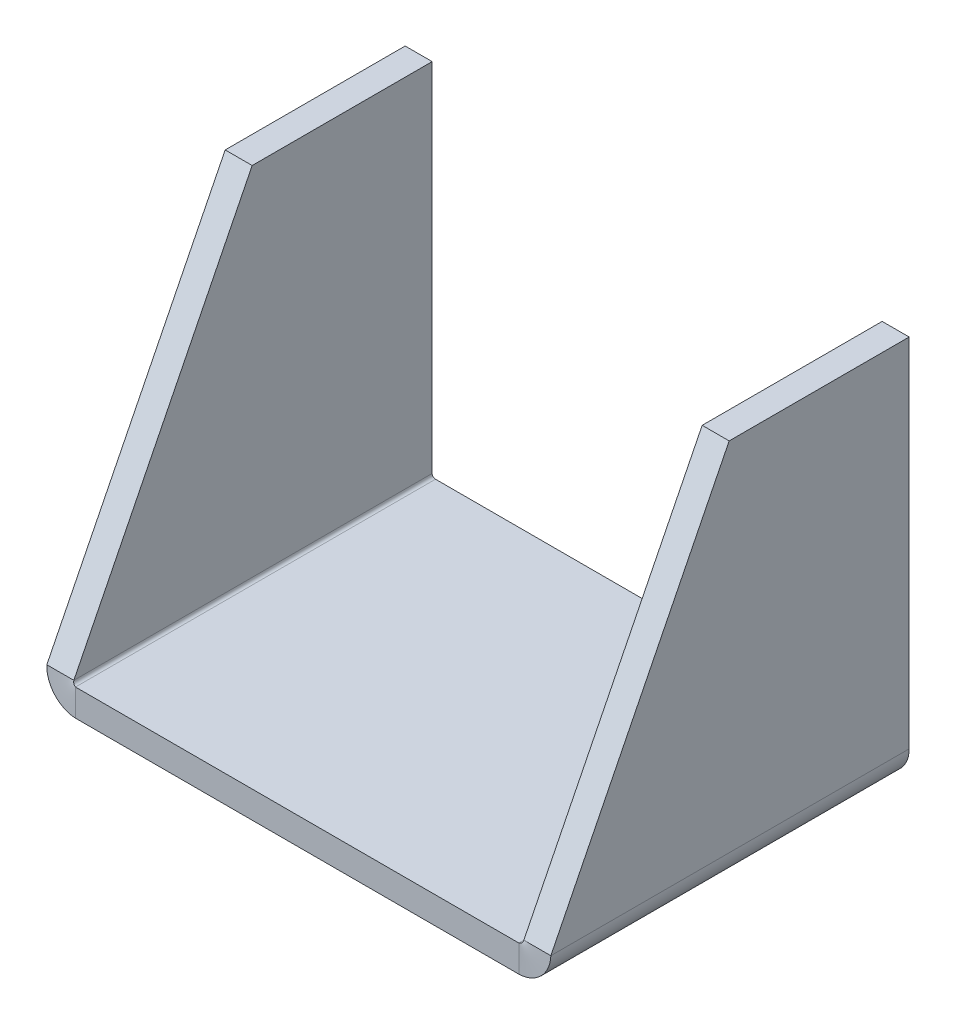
ISO-10303-21;
HEADER;
FILE_DESCRIPTION(('STEP AP214'),'2;1');
FILE_NAME('part.step','',(''),(''),'','','');
FILE_SCHEMA(('AUTOMOTIVE_DESIGN { 1 0 10303 214 1 1 1 1 }'));
ENDSEC;
DATA;
#1=APPLICATION_CONTEXT('core data for automotive mechanical design processes');
#2=APPLICATION_PROTOCOL_DEFINITION('international standard','automotive_design',2000,#1);
#3=PRODUCT_CONTEXT('',#1,'mechanical');
#4=PRODUCT('Part','Part','',(#3));
#5=PRODUCT_RELATED_PRODUCT_CATEGORY('part','',(#4));
#6=PRODUCT_DEFINITION_FORMATION('','',#4);
#7=PRODUCT_DEFINITION_CONTEXT('part definition',#1,'design');
#8=PRODUCT_DEFINITION('design','',#6,#7);
#9=PRODUCT_DEFINITION_SHAPE('','',#8);
#10=(LENGTH_UNIT() NAMED_UNIT(*) SI_UNIT(.MILLI.,.METRE.));
#11=(NAMED_UNIT(*) PLANE_ANGLE_UNIT() SI_UNIT($,.RADIAN.));
#12=(NAMED_UNIT(*) SI_UNIT($,.STERADIAN.) SOLID_ANGLE_UNIT());
#13=UNCERTAINTY_MEASURE_WITH_UNIT(LENGTH_MEASURE(1.E-05),#10,'distance_accuracy_value','');
#14=(GEOMETRIC_REPRESENTATION_CONTEXT(3) GLOBAL_UNCERTAINTY_ASSIGNED_CONTEXT((#13)) GLOBAL_UNIT_ASSIGNED_CONTEXT((#10,
#11,#12)) REPRESENTATION_CONTEXT('',''));
#15=CARTESIAN_POINT('',(0.,0.,0.));
#16=DIRECTION('',(0.,0.,1.));
#17=DIRECTION('',(1.,0.,0.));
#18=AXIS2_PLACEMENT_3D('',#15,#16,#17);
#19=CARTESIAN_POINT('',(-50.,-6.,80.));
#20=DIRECTION('',(0.,1.,0.));
#21=DIRECTION('',(0.,0.,1.));
#22=AXIS2_PLACEMENT_3D('',#19,#20,#21);
#23=PLANE('',#22);
#24=DIRECTION('',(0.,0.,-1.));
#25=VECTOR('',#24,1.);
#26=CARTESIAN_POINT('',(49.2634,-6.00000000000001,0.));
#27=LINE('',#26,#25);
#28=CARTESIAN_POINT('',(49.2634,-6.00000000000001,0.));
#29=VERTEX_POINT('',#28);
#30=CARTESIAN_POINT('',(49.2634,-6.00000000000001,80.));
#31=VERTEX_POINT('',#30);
#32=EDGE_CURVE('E174',#29,#31,#27,.F.);
#33=ORIENTED_EDGE('',*,*,#32,.T.);
#34=DIRECTION('',(1.,0.,0.));
#35=VECTOR('',#34,1.);
#36=CARTESIAN_POINT('',(-50.,-6.,80.));
#37=LINE('',#36,#35);
#38=CARTESIAN_POINT('',(-49.2634,-6.00000000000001,80.));
#39=VERTEX_POINT('',#38);
#40=EDGE_CURVE('E50',#39,#31,#37,.T.);
#41=ORIENTED_EDGE('',*,*,#40,.F.);
#42=DIRECTION('',(0.,0.,1.));
#43=VECTOR('',#42,1.);
#44=CARTESIAN_POINT('',(-49.2634,-6.00000000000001,80.));
#45=LINE('',#44,#43);
#46=CARTESIAN_POINT('',(-49.2634,-6.,0.));
#47=VERTEX_POINT('',#46);
#48=EDGE_CURVE('E260',#39,#47,#45,.F.);
#49=ORIENTED_EDGE('',*,*,#48,.T.);
#50=DIRECTION('',(1.,0.,0.));
#51=VECTOR('',#50,1.);
#52=CARTESIAN_POINT('',(-50.,-6.00000000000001,0.));
#53=LINE('',#52,#51);
#54=EDGE_CURVE('E334',#47,#29,#53,.T.);
#55=ORIENTED_EDGE('',*,*,#54,.T.);
#56=EDGE_LOOP('',(#33,#41,#49,#55));
#57=FACE_BOUND('',#56,.T.);
#58=ADVANCED_FACE('F43',(#57),#23,.F.);
#59=CARTESIAN_POINT('',(-49.9999999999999,0.,80.));
#60=DIRECTION('',(0.,1.,0.));
#61=DIRECTION('',(0.,0.,1.));
#62=AXIS2_PLACEMENT_3D('',#59,#60,#61);
#63=PLANE('',#62);
#64=DIRECTION('',(1.,0.,0.));
#65=VECTOR('',#64,1.);
#66=CARTESIAN_POINT('',(-49.9999999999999,0.,80.));
#67=LINE('',#66,#65);
#68=CARTESIAN_POINT('',(-49.2633999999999,0.,80.));
#69=VERTEX_POINT('',#68);
#70=CARTESIAN_POINT('',(49.2634,0.,80.));
#71=VERTEX_POINT('',#70);
#72=EDGE_CURVE('E11',#69,#71,#67,.T.);
#73=ORIENTED_EDGE('',*,*,#72,.T.);
#74=DIRECTION('',(0.,0.,-1.));
#75=VECTOR('',#74,1.);
#76=CARTESIAN_POINT('',(49.2634,0.,0.));
#77=LINE('',#76,#75);
#78=CARTESIAN_POINT('',(49.2634,0.,0.));
#79=VERTEX_POINT('',#78);
#80=EDGE_CURVE('E170',#79,#71,#77,.F.);
#81=ORIENTED_EDGE('',*,*,#80,.F.);
#82=DIRECTION('',(1.,0.,0.));
#83=VECTOR('',#82,1.);
#84=CARTESIAN_POINT('',(-50.,0.,0.));
#85=LINE('',#84,#83);
#86=CARTESIAN_POINT('',(-49.2634,0.,0.));
#87=VERTEX_POINT('',#86);
#88=EDGE_CURVE('E336',#87,#79,#85,.T.);
#89=ORIENTED_EDGE('',*,*,#88,.F.);
#90=DIRECTION('',(0.,0.,1.));
#91=VECTOR('',#90,1.);
#92=CARTESIAN_POINT('',(-49.2633999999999,0.,80.));
#93=LINE('',#92,#91);
#94=EDGE_CURVE('E56',#69,#87,#93,.F.);
#95=ORIENTED_EDGE('',*,*,#94,.F.);
#96=EDGE_LOOP('',(#73,#81,#89,#95));
#97=FACE_BOUND('',#96,.T.);
#98=ADVANCED_FACE('F305',(#97),#63,.T.);
#99=CARTESIAN_POINT('',(50.,-6.00000000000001,80.));
#100=DIRECTION('',(0.,0.,-1.));
#101=DIRECTION('',(-1.,0.,0.));
#102=AXIS2_PLACEMENT_3D('',#99,#100,#101);
#103=PLANE('',#102);
#104=DIRECTION('',(0.,-1.,0.));
#105=VECTOR('',#104,1.);
#106=CARTESIAN_POINT('',(49.2634,0.,80.));
#107=LINE('',#106,#105);
#108=EDGE_CURVE('E218',#71,#31,#107,.T.);
#109=ORIENTED_EDGE('',*,*,#108,.F.);
#110=ORIENTED_EDGE('',*,*,#72,.F.);
#111=DIRECTION('',(0.,-1.,0.));
#112=VECTOR('',#111,1.);
#113=CARTESIAN_POINT('',(-49.2633999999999,0.,80.));
#114=LINE('',#113,#112);
#115=EDGE_CURVE('E259',#69,#39,#114,.T.);
#116=ORIENTED_EDGE('',*,*,#115,.T.);
#117=ORIENTED_EDGE('',*,*,#40,.T.);
#118=EDGE_LOOP('',(#109,#110,#116,#117));
#119=FACE_BOUND('',#118,.T.);
#120=ADVANCED_FACE('F303',(#119),#103,.F.);
#121=CARTESIAN_POINT('',(50.,-6.00000000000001,0.));
#122=DIRECTION('',(0.,0.,-1.));
#123=DIRECTION('',(-1.,0.,0.));
#124=AXIS2_PLACEMENT_3D('',#121,#122,#123);
#125=PLANE('',#124);
#126=ORIENTED_EDGE('',*,*,#88,.T.);
#127=DIRECTION('',(0.,-1.,0.));
#128=VECTOR('',#127,1.);
#129=CARTESIAN_POINT('',(49.2634,0.,0.));
#130=LINE('',#129,#128);
#131=EDGE_CURVE('E210',#79,#29,#130,.T.);
#132=ORIENTED_EDGE('',*,*,#131,.T.);
#133=ORIENTED_EDGE('',*,*,#54,.F.);
#134=DIRECTION('',(0.,-1.,0.));
#135=VECTOR('',#134,1.);
#136=CARTESIAN_POINT('',(-49.2634,0.,0.));
#137=LINE('',#136,#135);
#138=EDGE_CURVE('E64',#87,#47,#137,.T.);
#139=ORIENTED_EDGE('',*,*,#138,.F.);
#140=EDGE_LOOP('',(#126,#132,#133,#139));
#141=FACE_BOUND('',#140,.T.);
#142=ADVANCED_FACE('F289',(#141),#125,.T.);
#143=CARTESIAN_POINT('',(-49.2634,0.736600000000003,0.));
#144=DIRECTION('',(0.,0.,-1.));
#145=DIRECTION('',(0.,1.,0.));
#146=AXIS2_PLACEMENT_3D('',#143,#144,#145);
#147=PLANE('',#146);
#148=DIRECTION('',(-1.,0.,0.));
#149=VECTOR('',#148,1.);
#150=CARTESIAN_POINT('',(-50.,0.7366,0.));
#151=LINE('',#150,#149);
#152=CARTESIAN_POINT('',(-50.,0.736600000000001,0.));
#153=VERTEX_POINT('',#152);
#154=CARTESIAN_POINT('',(-56.,0.73659999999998,0.));
#155=VERTEX_POINT('',#154);
#156=EDGE_CURVE('E221',#153,#155,#151,.T.);
#157=ORIENTED_EDGE('',*,*,#156,.F.);
#158=CARTESIAN_POINT('',(-49.2634,0.736600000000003,0.));
#159=DIRECTION('',(0.,0.,1.));
#160=DIRECTION('',(0.,-1.,0.));
#161=AXIS2_PLACEMENT_3D('',#158,#159,#160);
#162=CIRCLE('',#161,0.736599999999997);
#163=EDGE_CURVE('E252',#87,#153,#162,.F.);
#164=ORIENTED_EDGE('',*,*,#163,.F.);
#165=ORIENTED_EDGE('',*,*,#138,.T.);
#166=CARTESIAN_POINT('',(-49.2634,0.736600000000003,0.));
#167=DIRECTION('',(0.,0.,1.));
#168=DIRECTION('',(0.,-1.,0.));
#169=AXIS2_PLACEMENT_3D('',#166,#167,#168);
#170=CIRCLE('',#169,6.7366);
#171=EDGE_CURVE('E256',#47,#155,#170,.F.);
#172=ORIENTED_EDGE('',*,*,#171,.T.);
#173=EDGE_LOOP('',(#157,#164,#165,#172));
#174=FACE_BOUND('',#173,.T.);
#175=ADVANCED_FACE('F286',(#174),#147,.T.);
#176=CARTESIAN_POINT('',(-56.0599999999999,0.736599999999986,79.6317));
#177=CARTESIAN_POINT('',(-56.0599999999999,-0.153233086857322,79.6623971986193));
#178=CARTESIAN_POINT('',(-55.8831026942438,-1.0423956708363,79.6930833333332));
#179=CARTESIAN_POINT('',(-55.2021765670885,-2.68629676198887,79.7544666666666));
#180=CARTESIAN_POINT('',(-54.6984156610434,-3.44022823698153,79.7851583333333));
#181=CARTESIAN_POINT('',(-53.4402282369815,-4.69841566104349,79.8465416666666));
#182=CARTESIAN_POINT('',(-52.6862967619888,-5.20217656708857,79.8772333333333));
#183=CARTESIAN_POINT('',(-51.0423956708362,-5.88310269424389,79.9386166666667));
#184=CARTESIAN_POINT('',(-50.1532330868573,-6.06,79.9693028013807));
#185=CARTESIAN_POINT('',(-49.2634,-6.06000000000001,80.));
#186=CARTESIAN_POINT('',(-56.,0.736599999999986,79.6317));
#187=CARTESIAN_POINT('',(-56.,-0.145377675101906,79.6623971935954));
#188=CARTESIAN_POINT('',(-55.8246643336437,-1.02669079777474,79.6930833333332));
#189=CARTESIAN_POINT('',(-55.1497493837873,-2.65607962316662,79.7544666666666));
#190=CARTESIAN_POINT('',(-54.6504356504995,-3.40335543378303,79.7851583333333));
#191=CARTESIAN_POINT('',(-53.403355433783,-4.6504356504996,79.8465416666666));
#192=CARTESIAN_POINT('',(-52.6560796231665,-5.14974938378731,79.8772333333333));
#193=CARTESIAN_POINT('',(-51.0266907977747,-5.82466433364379,79.9386166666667));
#194=CARTESIAN_POINT('',(-50.1453776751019,-6.,79.9693028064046));
#195=CARTESIAN_POINT('',(-49.2634,-6.00000000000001,80.));
#196=CARTESIAN_POINT('',(-50.,0.736599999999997,79.6317));
#197=CARTESIAN_POINT('',(-50.,0.640163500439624,79.662396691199));
#198=CARTESIAN_POINT('',(-49.9808282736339,0.543796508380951,79.6930833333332));
#199=CARTESIAN_POINT('',(-49.9070310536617,0.365634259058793,79.7544666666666));
#200=CARTESIAN_POINT('',(-49.8524345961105,0.283924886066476,79.7851583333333));
#201=CARTESIAN_POINT('',(-49.7160751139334,0.1475654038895,79.8465416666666));
#202=CARTESIAN_POINT('',(-49.6343657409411,0.092968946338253,79.8772333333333));
#203=CARTESIAN_POINT('',(-49.4562034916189,0.0191717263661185,79.9386166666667));
#204=CARTESIAN_POINT('',(-49.3598364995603,0.,79.9693033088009));
#205=CARTESIAN_POINT('',(-49.2633999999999,0.,80.));
#206=CARTESIAN_POINT('',(-49.9394,0.736599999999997,79.6317));
#207=CARTESIAN_POINT('',(-49.9394,0.648097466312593,79.6623966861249));
#208=CARTESIAN_POINT('',(-49.9218055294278,0.559658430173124,79.6930833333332));
#209=CARTESIAN_POINT('',(-49.8540795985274,0.39615356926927,79.7544666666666));
#210=CARTESIAN_POINT('',(-49.8039747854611,0.321166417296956,79.7851583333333));
#211=CARTESIAN_POINT('',(-49.678833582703,0.19602521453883,79.8465416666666));
#212=CARTESIAN_POINT('',(-49.6038464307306,0.145920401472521,79.8772333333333));
#213=CARTESIAN_POINT('',(-49.4403415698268,0.0781944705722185,79.9386166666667));
#214=CARTESIAN_POINT('',(-49.3519025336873,0.0605999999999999,79.9693033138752));
#215=CARTESIAN_POINT('',(-49.2633999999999,0.0605999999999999,80.));
#216=B_SPLINE_SURFACE_WITH_KNOTS('',1,3,((#176,#177,#178,#179,#180,#181,#182,#183,#184,#185),
(#186,#187,#188,#189,#190,#191,#192,#193,#194,#195),(#196,#197,#198,#199,#200,#201,#202,#203,
#204,#205),(#206,#207,#208,#209,#210,#211,#212,#213,#214,#215)),.UNSPECIFIED.,.F.,.F.,.F.,(2,1,
1,2),(4,2,2,2,4),(-0.01,0.,1.,1.0101),(0.,0.25,0.5,0.75,1.),.UNSPECIFIED.);
#217=CARTESIAN_POINT('',(-49.9999999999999,0.736599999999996,79.6317));
#218=CARTESIAN_POINT('',(-50.0000002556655,0.724547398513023,79.6355364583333));
#219=CARTESIAN_POINT('',(-49.9997041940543,0.712494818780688,79.6393729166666));
#220=CARTESIAN_POINT('',(-49.998521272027,0.688418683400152,79.6470458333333));
#221=CARTESIAN_POINT('',(-49.9976344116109,0.67639512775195,79.6508822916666));
#222=CARTESIAN_POINT('',(-49.9952717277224,0.652406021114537,79.6585552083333));
#223=CARTESIAN_POINT('',(-49.9937959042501,0.640440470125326,79.6623916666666));
#224=CARTESIAN_POINT('',(-49.9902589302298,0.616596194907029,79.6700645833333));
#225=CARTESIAN_POINT('',(-49.9881977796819,0.604717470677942,79.6739010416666));
#226=CARTESIAN_POINT('',(-49.9834950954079,0.581075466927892,79.6815739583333));
#227=CARTESIAN_POINT('',(-49.9808535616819,0.569312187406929,79.6854104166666));
#228=CARTESIAN_POINT('',(-49.9749964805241,0.545929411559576,79.6930833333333));
#229=CARTESIAN_POINT('',(-49.9717809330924,0.534309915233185,79.6969197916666));
#230=CARTESIAN_POINT('',(-49.9647835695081,0.511242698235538,79.7045927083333));
#231=CARTESIAN_POINT('',(-49.9610017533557,0.499794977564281,79.7084291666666));
#232=CARTESIAN_POINT('',(-49.9528809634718,0.477098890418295,79.7161020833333));
#233=CARTESIAN_POINT('',(-49.9485419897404,0.465850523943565,79.7199385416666));
#234=CARTESIAN_POINT('',(-49.9393173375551,0.44358024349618,79.7276114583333));
#235=CARTESIAN_POINT('',(-49.9344316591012,0.432558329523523,79.7314479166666));
#236=CARTESIAN_POINT('',(-49.9241253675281,0.410767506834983,79.7391208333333));
#237=CARTESIAN_POINT('',(-49.9187047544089,0.399998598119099,79.7429572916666));
#238=CARTESIAN_POINT('',(-49.9073416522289,0.378739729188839,79.7506302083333));
#239=CARTESIAN_POINT('',(-49.9013991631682,0.368249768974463,79.7544666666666));
#240=CARTESIAN_POINT('',(-49.889006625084,0.34757406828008,79.7621395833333));
#241=CARTESIAN_POINT('',(-49.8825565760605,0.337388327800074,79.7659760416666));
#242=CARTESIAN_POINT('',(-49.8691644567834,0.317345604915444,79.7736489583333));
#243=CARTESIAN_POINT('',(-49.8622223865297,0.307488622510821,79.7774854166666));
#244=CARTESIAN_POINT('',(-49.8478629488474,0.288127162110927,79.7851583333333));
#245=CARTESIAN_POINT('',(-49.8404455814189,0.278622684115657,79.7889947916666));
#246=CARTESIAN_POINT('',(-49.8251534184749,0.259989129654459,79.7966677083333));
#247=CARTESIAN_POINT('',(-49.8172786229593,0.250860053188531,79.8005041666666));
#248=CARTESIAN_POINT('',(-49.8010905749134,0.232999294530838,79.8081770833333));
#249=CARTESIAN_POINT('',(-49.792777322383,0.224267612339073,79.8120135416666));
#250=CARTESIAN_POINT('',(-49.7757323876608,0.207222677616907,79.8196864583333));
#251=CARTESIAN_POINT('',(-49.7670007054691,0.198909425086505,79.8235229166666));
#252=CARTESIAN_POINT('',(-49.7491399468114,0.182721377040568,79.8311958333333));
#253=CARTESIAN_POINT('',(-49.7400108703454,0.174846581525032,79.8350322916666));
#254=CARTESIAN_POINT('',(-49.7213773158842,0.159554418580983,79.8427052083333));
#255=CARTESIAN_POINT('',(-49.711872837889,0.15213705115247,79.8465416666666));
#256=CARTESIAN_POINT('',(-49.6925113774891,0.137777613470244,79.8542145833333));
#257=CARTESIAN_POINT('',(-49.6826543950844,0.130835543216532,79.8580510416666));
#258=CARTESIAN_POINT('',(-49.6626116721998,0.117443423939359,79.8657239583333));
#259=CARTESIAN_POINT('',(-49.6524259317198,0.110993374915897,79.8695604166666));
#260=CARTESIAN_POINT('',(-49.6317502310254,0.0986008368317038,79.8772333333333));
#261=CARTESIAN_POINT('',(-49.6212602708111,0.0926583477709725,79.8810697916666));
#262=CARTESIAN_POINT('',(-49.6000014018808,0.0812952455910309,79.8887427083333));
#263=CARTESIAN_POINT('',(-49.5892324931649,0.0758746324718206,79.8925791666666));
#264=CARTESIAN_POINT('',(-49.5674416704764,0.0655683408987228,79.9002520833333));
#265=CARTESIAN_POINT('',(-49.5564197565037,0.0606826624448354,79.9040885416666));
#266=CARTESIAN_POINT('',(-49.5341494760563,0.0514580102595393,79.9117614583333));
#267=CARTESIAN_POINT('',(-49.5229011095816,0.0471190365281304,79.9155979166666));
#268=CARTESIAN_POINT('',(-49.5002050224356,0.0389982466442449,79.9232708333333));
#269=CARTESIAN_POINT('',(-49.4887573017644,0.0352164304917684,79.9271072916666));
#270=CARTESIAN_POINT('',(-49.4656900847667,0.0282190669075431,79.9347802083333));
#271=CARTESIAN_POINT('',(-49.4540705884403,0.0250035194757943,79.9386166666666));
#272=CARTESIAN_POINT('',(-49.430687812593,0.019146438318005,79.9462895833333));
#273=CARTESIAN_POINT('',(-49.418924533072,0.0165049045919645,79.9501260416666));
#274=CARTESIAN_POINT('',(-49.395282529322,0.0118022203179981,79.9577989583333));
#275=CARTESIAN_POINT('',(-49.3834038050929,0.00974106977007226,79.9616354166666));
#276=CARTESIAN_POINT('',(-49.3595595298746,0.00620409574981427,79.9693083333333));
#277=CARTESIAN_POINT('',(-49.3475939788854,0.0047282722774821,79.9731447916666));
#278=CARTESIAN_POINT('',(-49.323604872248,0.00236558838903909,79.9808177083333));
#279=CARTESIAN_POINT('',(-49.3115813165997,0.00147872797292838,79.9846541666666));
#280=CARTESIAN_POINT('',(-49.2875051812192,0.000295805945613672,79.9923270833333));
#281=CARTESIAN_POINT('',(-49.2754526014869,-2.5566559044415E-07,79.9961635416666));
#282=CARTESIAN_POINT('',(-49.2633999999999,0.,80.));
#283=B_SPLINE_CURVE_WITH_KNOTS('',3,(#217,#218,#219,#220,#221,#222,#223,#224,#225,#226,#227,
#228,#229,#230,#231,#232,#233,#234,#235,#236,#237,#238,#239,#240,#241,#242,#243,#244,#245,#246,
#247,#248,#249,#250,#251,#252,#253,#254,#255,#256,#257,#258,#259,#260,#261,#262,#263,#264,#265,
#266,#267,#268,#269,#270,#271,#272,#273,#274,#275,#276,#277,#278,#279,#280,#281,#282),
.UNSPECIFIED.,.F.,.F.,(4,2,2,2,2,2,2,2,2,2,2,2,2,2,2,2,2,2,2,2,2,2,2,2,2,2,2,2,2,2,2,2,4),(0.,
0.0379418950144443,0.0758837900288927,0.113825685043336,0.151767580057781,0.189709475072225,
0.227651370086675,0.265593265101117,0.303535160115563,0.34147705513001,0.379418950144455,
0.417360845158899,0.455302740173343,0.493244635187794,0.531186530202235,0.569128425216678,
0.607070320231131,0.645012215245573,0.682954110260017,0.720896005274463,0.75883790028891,
0.796779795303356,0.834721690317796,0.872663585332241,0.910605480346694,0.948547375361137,
0.986489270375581,1.02443116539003,1.06237306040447,1.10031495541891,1.13825685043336,
1.17619874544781,1.21414064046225),.UNSPECIFIED.);
#284=CARTESIAN_POINT('',(-50.,0.736599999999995,79.6317));
#285=VERTEX_POINT('',#284);
#286=EDGE_CURVE('E251',#285,#69,#283,.T.);
#287=DIRECTION('',(-1.,0.,0.));
#288=VECTOR('',#287,1.);
#289=CARTESIAN_POINT('',(-50.,0.736599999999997,79.6317));
#290=LINE('',#289,#288);
#291=CARTESIAN_POINT('',(-56.,0.736599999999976,79.6317));
#292=VERTEX_POINT('',#291);
#293=EDGE_CURVE('E224',#285,#292,#290,.T.);
#294=CARTESIAN_POINT('',(-55.9999999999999,0.736599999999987,79.6317));
#295=CARTESIAN_POINT('',(-56.0000023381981,0.626372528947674,79.6355364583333));
#296=CARTESIAN_POINT('',(-55.9972946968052,0.516145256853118,79.6393729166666));
#297=CARTESIAN_POINT('',(-55.9864762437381,0.295956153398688,79.6470458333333));
#298=CARTESIAN_POINT('',(-55.978365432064,0.185994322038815,79.6508822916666));
#299=CARTESIAN_POINT('',(-55.9567574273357,-0.0333988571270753,79.6585552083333));
#300=CARTESIAN_POINT('',(-55.9432602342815,-0.142830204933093,79.6623916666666));
#301=CARTESIAN_POINT('',(-55.9109127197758,-0.36089882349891,79.6700645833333));
#302=CARTESIAN_POINT('',(-55.8920623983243,-0.469536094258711,79.6739010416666));
#303=CARTESIAN_POINT('',(-55.8490538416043,-0.685754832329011,79.6815739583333));
#304=CARTESIAN_POINT('',(-55.8248956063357,-0.793336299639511,79.6854104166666));
#305=CARTESIAN_POINT('',(-55.7713294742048,-1.00718426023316,79.6930833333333));
#306=CARTESIAN_POINT('',(-55.7419215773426,-1.11345075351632,79.6969197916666));
#307=CARTESIAN_POINT('',(-55.6779269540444,-1.32441276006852,79.7045927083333));
#308=CARTESIAN_POINT('',(-55.6433402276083,-1.42910827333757,79.7084291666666));
#309=CARTESIAN_POINT('',(-55.5690712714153,-1.63667609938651,79.7161020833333));
#310=CARTESIAN_POINT('',(-55.5293890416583,-1.73954841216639,79.7199385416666));
#311=CARTESIAN_POINT('',(-55.4450246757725,-1.94322200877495,79.7276114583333));
#312=CARTESIAN_POINT('',(-55.4003425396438,-2.04402329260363,79.7314479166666));
#313=CARTESIAN_POINT('',(-55.3060860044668,-2.24331199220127,79.7391208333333));
#314=CARTESIAN_POINT('',(-55.2565116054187,-2.34179940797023,79.7429572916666));
#315=CARTESIAN_POINT('',(-55.1525899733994,-2.53622310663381,79.7506302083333));
#316=CARTESIAN_POINT('',(-55.0982427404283,-2.63215938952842,79.7544666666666));
#317=CARTESIAN_POINT('',(-54.9849063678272,-2.82124970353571,79.7621395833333));
#318=CARTESIAN_POINT('',(-54.9259172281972,-2.9144037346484,79.7659760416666));
#319=CARTESIAN_POINT('',(-54.8034391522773,-3.09770512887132,79.7736489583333));
#320=CARTESIAN_POINT('',(-54.7399502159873,-3.18785249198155,79.7774854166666));
#321=CARTESIAN_POINT('',(-54.6086254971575,-3.36492337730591,79.7851583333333));
#322=CARTESIAN_POINT('',(-54.5407897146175,-3.45184689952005,79.7889947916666));
#323=CARTESIAN_POINT('',(-54.4009347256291,-3.62226069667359,79.7966677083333));
#324=CARTESIAN_POINT('',(-54.3289155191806,-3.70575097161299,79.8005041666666));
#325=CARTESIAN_POINT('',(-54.1808671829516,-3.86909713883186,79.8081770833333));
#326=CARTESIAN_POINT('',(-54.1048380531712,-3.94895303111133,79.8120135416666));
#327=CARTESIAN_POINT('',(-53.9489530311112,-4.10483805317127,79.8196864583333));
#328=CARTESIAN_POINT('',(-53.8690971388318,-4.18086718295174,79.8235229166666));
#329=CARTESIAN_POINT('',(-53.7057509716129,-4.3289155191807,79.8311958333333));
#330=CARTESIAN_POINT('',(-53.6222606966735,-4.4009347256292,79.8350322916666));
#331=CARTESIAN_POINT('',(-53.4518468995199,-4.54078971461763,79.8427052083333));
#332=CARTESIAN_POINT('',(-53.3649233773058,-4.60862549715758,79.8465416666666));
#333=CARTESIAN_POINT('',(-53.1878524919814,-4.73995021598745,79.8542145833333));
#334=CARTESIAN_POINT('',(-53.0977051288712,-4.80343915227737,79.8580510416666));
#335=CARTESIAN_POINT('',(-52.9144037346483,-4.92591722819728,79.8657239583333));
#336=CARTESIAN_POINT('',(-52.8212497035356,-4.98490636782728,79.8695604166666));
#337=CARTESIAN_POINT('',(-52.6321593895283,-5.09824274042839,79.8772333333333));
#338=CARTESIAN_POINT('',(-52.5362231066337,-5.15258997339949,79.8810697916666));
#339=CARTESIAN_POINT('',(-52.3417994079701,-5.25651160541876,79.8887427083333));
#340=CARTESIAN_POINT('',(-52.2433119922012,-5.30608600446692,79.8925791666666));
#341=CARTESIAN_POINT('',(-52.0440232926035,-5.40034253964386,79.9002520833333));
#342=CARTESIAN_POINT('',(-51.9432220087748,-5.44502467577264,79.9040885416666));
#343=CARTESIAN_POINT('',(-51.7395484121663,-5.52938904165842,79.9117614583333));
#344=CARTESIAN_POINT('',(-51.6366760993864,-5.56907127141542,79.9155979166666));
#345=CARTESIAN_POINT('',(-51.4291082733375,-5.64334022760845,79.9232708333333));
#346=CARTESIAN_POINT('',(-51.3244127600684,-5.67792695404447,79.9271072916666));
#347=CARTESIAN_POINT('',(-51.1134507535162,-5.74192157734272,79.9347802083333));
#348=CARTESIAN_POINT('',(-51.0071842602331,-5.77132947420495,79.9386166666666));
#349=CARTESIAN_POINT('',(-50.7933362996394,-5.82489560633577,79.9462895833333));
#350=CARTESIAN_POINT('',(-50.6857548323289,-5.84905384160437,79.9501260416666));
#351=CARTESIAN_POINT('',(-50.4695360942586,-5.89206239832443,79.9577989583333));
#352=CARTESIAN_POINT('',(-50.3608988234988,-5.91091271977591,79.9616354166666));
#353=CARTESIAN_POINT('',(-50.142830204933,-5.94326023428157,79.9693083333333));
#354=CARTESIAN_POINT('',(-50.033398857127,-5.95675742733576,79.9731447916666));
#355=CARTESIAN_POINT('',(-49.8140056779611,-5.97836543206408,79.9808177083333));
#356=CARTESIAN_POINT('',(-49.7040438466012,-5.98647624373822,79.9846541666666));
#357=CARTESIAN_POINT('',(-49.4838547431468,-5.9972946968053,79.9923270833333));
#358=CARTESIAN_POINT('',(-49.3736274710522,-6.00000233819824,79.9961635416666));
#359=CARTESIAN_POINT('',(-49.2633999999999,-6.,80.));
#360=B_SPLINE_CURVE_WITH_KNOTS('',3,(#294,#295,#296,#297,#298,#299,#300,#301,#302,#303,#304,
#305,#306,#307,#308,#309,#310,#311,#312,#313,#314,#315,#316,#317,#318,#319,#320,#321,#322,#323,
#324,#325,#326,#327,#328,#329,#330,#331,#332,#333,#334,#335,#336,#337,#338,#339,#340,#341,#342,
#343,#344,#345,#346,#347,#348,#349,#350,#351,#352,#353,#354,#355,#356,#357,#358,#359),
.UNSPECIFIED.,.F.,.F.,(4,2,2,2,2,2,2,2,2,2,2,2,2,2,2,2,2,2,2,2,2,2,2,2,2,2,2,2,2,2,2,2,4),(0.,
0.330849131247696,0.661698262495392,0.992547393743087,1.32339652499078,1.65424565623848,
1.98509478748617,2.31594391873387,2.64679304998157,2.97764218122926,3.30849131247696,
3.63934044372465,3.97018957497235,4.30103870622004,4.63188783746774,4.96273696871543,
5.29358609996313,5.62443523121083,5.95528436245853,6.28613349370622,6.61698262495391,
6.94783175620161,7.27868088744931,7.609530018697,7.9403791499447,8.27122828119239,
8.60207741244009,8.93292654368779,9.26377567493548,9.59462480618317,9.92547393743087,
10.2563230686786,10.5871721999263),.UNSPECIFIED.);
#361=EDGE_CURVE('E255',#292,#39,#360,.T.);
#362=ORIENTED_EDGE('',*,*,#286,.F.);
#363=ORIENTED_EDGE('',*,*,#293,.T.);
#364=ORIENTED_EDGE('',*,*,#361,.T.);
#365=ORIENTED_EDGE('',*,*,#115,.F.);
#366=EDGE_LOOP('',(#362,#363,#364,#365));
#367=FACE_BOUND('',#366,.T.);
#368=ADVANCED_FACE('F280',(#367),#216,.F.);
#369=CARTESIAN_POINT('',(-49.2633999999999,0.736599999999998,80.));
#370=DIRECTION('',(0.,0.,1.));
#371=DIRECTION('',(-1.,0.,0.));
#372=AXIS2_PLACEMENT_3D('',#369,#370,#371);
#373=CYLINDRICAL_SURFACE('',#372,6.7366);
#374=ORIENTED_EDGE('',*,*,#48,.F.);
#375=ORIENTED_EDGE('',*,*,#361,.F.);
#376=DIRECTION('',(0.,0.,-1.));
#377=VECTOR('',#376,1.);
#378=CARTESIAN_POINT('',(-55.9999999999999,0.736599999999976,80.));
#379=LINE('',#378,#377);
#380=EDGE_CURVE('E227',#292,#155,#379,.T.);
#381=ORIENTED_EDGE('',*,*,#380,.T.);
#382=ORIENTED_EDGE('',*,*,#171,.F.);
#383=EDGE_LOOP('',(#374,#375,#381,#382));
#384=FACE_BOUND('',#383,.T.);
#385=ADVANCED_FACE('F278',(#384),#373,.T.);
#386=CARTESIAN_POINT('',(-49.2633999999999,0.736599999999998,80.));
#387=DIRECTION('',(0.,0.,1.));
#388=DIRECTION('',(-1.,0.,0.));
#389=AXIS2_PLACEMENT_3D('',#386,#387,#388);
#390=CYLINDRICAL_SURFACE('',#389,0.736599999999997);
#391=ORIENTED_EDGE('',*,*,#94,.T.);
#392=ORIENTED_EDGE('',*,*,#163,.T.);
#393=DIRECTION('',(0.,0.,1.));
#394=VECTOR('',#393,1.);
#395=CARTESIAN_POINT('',(-50.,0.7366,0.));
#396=LINE('',#395,#394);
#397=EDGE_CURVE('E222',#153,#285,#396,.T.);
#398=ORIENTED_EDGE('',*,*,#397,.T.);
#399=ORIENTED_EDGE('',*,*,#286,.T.);
#400=EDGE_LOOP('',(#391,#392,#398,#399));
#401=FACE_BOUND('',#400,.T.);
#402=ADVANCED_FACE('F268',(#401),#390,.F.);
#403=CARTESIAN_POINT('',(-56.0000000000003,80.,40.));
#404=DIRECTION('',(0.,-0.447213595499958,-0.894427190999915));
#405=DIRECTION('',(0.,0.894427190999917,-0.447213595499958));
#406=AXIS2_PLACEMENT_3D('',#403,#404,#405);
#407=PLANE('',#406);
#408=ORIENTED_EDGE('',*,*,#293,.F.);
#409=DIRECTION('',(0.,0.894427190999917,-0.447213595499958));
#410=VECTOR('',#409,1.);
#411=CARTESIAN_POINT('',(-50.0000000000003,80.,40.));
#412=LINE('',#411,#410);
#413=CARTESIAN_POINT('',(-50.0000000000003,80.,40.));
#414=VERTEX_POINT('',#413);
#415=EDGE_CURVE('E231',#285,#414,#412,.T.);
#416=ORIENTED_EDGE('',*,*,#415,.T.);
#417=DIRECTION('',(1.,0.,0.));
#418=VECTOR('',#417,1.);
#419=CARTESIAN_POINT('',(-56.0000000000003,80.,40.));
#420=LINE('',#419,#418);
#421=CARTESIAN_POINT('',(-56.0000000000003,80.,40.));
#422=VERTEX_POINT('',#421);
#423=EDGE_CURVE('E248',#422,#414,#420,.T.);
#424=ORIENTED_EDGE('',*,*,#423,.F.);
#425=DIRECTION('',(0.,0.894427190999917,-0.447213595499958));
#426=VECTOR('',#425,1.);
#427=CARTESIAN_POINT('',(-56.0000000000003,80.,40.));
#428=LINE('',#427,#426);
#429=EDGE_CURVE('E238',#292,#422,#428,.T.);
#430=ORIENTED_EDGE('',*,*,#429,.F.);
#431=EDGE_LOOP('',(#408,#416,#424,#430));
#432=FACE_BOUND('',#431,.T.);
#433=ADVANCED_FACE('F277',(#432),#407,.F.);
#434=CARTESIAN_POINT('',(-56.,0.,0.));
#435=DIRECTION('',(0.,0.,1.));
#436=DIRECTION('',(1.,0.,0.));
#437=AXIS2_PLACEMENT_3D('',#434,#435,#436);
#438=PLANE('',#437);
#439=ORIENTED_EDGE('',*,*,#156,.T.);
#440=DIRECTION('',(0.,-1.,0.));
#441=VECTOR('',#440,1.);
#442=CARTESIAN_POINT('',(-56.,0.,0.));
#443=LINE('',#442,#441);
#444=CARTESIAN_POINT('',(-56.0000000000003,80.,2.22044604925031E-13));
#445=VERTEX_POINT('',#444);
#446=EDGE_CURVE('E242',#445,#155,#443,.T.);
#447=ORIENTED_EDGE('',*,*,#446,.F.);
#448=DIRECTION('',(1.,0.,0.));
#449=VECTOR('',#448,1.);
#450=CARTESIAN_POINT('',(-56.0000000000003,80.,2.22044604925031E-13));
#451=LINE('',#450,#449);
#452=CARTESIAN_POINT('',(-50.0000000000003,80.,0.));
#453=VERTEX_POINT('',#452);
#454=EDGE_CURVE('E245',#445,#453,#451,.T.);
#455=ORIENTED_EDGE('',*,*,#454,.T.);
#456=DIRECTION('',(0.,-1.,0.));
#457=VECTOR('',#456,1.);
#458=CARTESIAN_POINT('',(-50.,0.,0.));
#459=LINE('',#458,#457);
#460=EDGE_CURVE('E235',#453,#153,#459,.T.);
#461=ORIENTED_EDGE('',*,*,#460,.T.);
#462=EDGE_LOOP('',(#439,#447,#455,#461));
#463=FACE_BOUND('',#462,.T.);
#464=ADVANCED_FACE('F352',(#463),#438,.F.);
#465=CARTESIAN_POINT('',(-55.9999999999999,0.,80.));
#466=DIRECTION('',(1.,0.,0.));
#467=DIRECTION('',(0.,1.,0.));
#468=AXIS2_PLACEMENT_3D('',#465,#466,#467);
#469=PLANE('',#468);
#470=ORIENTED_EDGE('',*,*,#380,.F.);
#471=ORIENTED_EDGE('',*,*,#429,.T.);
#472=DIRECTION('',(0.,0.,-1.));
#473=VECTOR('',#472,1.);
#474=CARTESIAN_POINT('',(-56.0000000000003,80.,2.22044604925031E-13));
#475=LINE('',#474,#473);
#476=EDGE_CURVE('E240',#422,#445,#475,.T.);
#477=ORIENTED_EDGE('',*,*,#476,.T.);
#478=ORIENTED_EDGE('',*,*,#446,.T.);
#479=EDGE_LOOP('',(#470,#471,#477,#478));
#480=FACE_BOUND('',#479,.T.);
#481=ADVANCED_FACE('F355',(#480),#469,.F.);
#482=CARTESIAN_POINT('',(-49.9999999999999,0.,80.));
#483=DIRECTION('',(1.,0.,0.));
#484=DIRECTION('',(0.,1.,0.));
#485=AXIS2_PLACEMENT_3D('',#482,#483,#484);
#486=PLANE('',#485);
#487=ORIENTED_EDGE('',*,*,#415,.F.);
#488=ORIENTED_EDGE('',*,*,#397,.F.);
#489=ORIENTED_EDGE('',*,*,#460,.F.);
#490=DIRECTION('',(0.,0.,-1.));
#491=VECTOR('',#490,1.);
#492=CARTESIAN_POINT('',(-50.0000000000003,80.,0.));
#493=LINE('',#492,#491);
#494=EDGE_CURVE('E233',#414,#453,#493,.T.);
#495=ORIENTED_EDGE('',*,*,#494,.F.);
#496=EDGE_LOOP('',(#487,#488,#489,#495));
#497=FACE_BOUND('',#496,.T.);
#498=ADVANCED_FACE('F366',(#497),#486,.T.);
#499=CARTESIAN_POINT('',(-56.0000000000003,80.,2.22044604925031E-13));
#500=DIRECTION('',(0.,-1.,0.));
#501=DIRECTION('',(1.,0.,0.));
#502=AXIS2_PLACEMENT_3D('',#499,#500,#501);
#503=PLANE('',#502);
#504=ORIENTED_EDGE('',*,*,#494,.T.);
#505=ORIENTED_EDGE('',*,*,#454,.F.);
#506=ORIENTED_EDGE('',*,*,#476,.F.);
#507=ORIENTED_EDGE('',*,*,#423,.T.);
#508=EDGE_LOOP('',(#504,#505,#506,#507));
#509=FACE_BOUND('',#508,.T.);
#510=ADVANCED_FACE('F361',(#509),#503,.F.);
#511=CARTESIAN_POINT('',(49.2634,-6.06,80.));
#512=CARTESIAN_POINT('',(50.1532330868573,-6.06,79.9693028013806));
#513=CARTESIAN_POINT('',(51.0423956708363,-5.88310269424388,79.9386166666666));
#514=CARTESIAN_POINT('',(52.6862967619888,-5.20217656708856,79.8772333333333));
#515=CARTESIAN_POINT('',(53.4402282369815,-4.69841566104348,79.8465416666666));
#516=CARTESIAN_POINT('',(54.6984156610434,-3.44022823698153,79.7851583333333));
#517=CARTESIAN_POINT('',(55.2021765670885,-2.68629676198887,79.7544666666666));
#518=CARTESIAN_POINT('',(55.8831026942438,-1.0423956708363,79.6930833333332));
#519=CARTESIAN_POINT('',(56.06,-0.153233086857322,79.6623971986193));
#520=CARTESIAN_POINT('',(56.06,0.736599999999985,79.6317));
#521=CARTESIAN_POINT('',(49.2634,-6.,80.));
#522=CARTESIAN_POINT('',(50.1453776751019,-6.,79.9693028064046));
#523=CARTESIAN_POINT('',(51.0266907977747,-5.82466433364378,79.9386166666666));
#524=CARTESIAN_POINT('',(52.6560796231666,-5.14974938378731,79.8772333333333));
#525=CARTESIAN_POINT('',(53.403355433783,-4.65043565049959,79.8465416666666));
#526=CARTESIAN_POINT('',(54.6504356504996,-3.40335543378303,79.7851583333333));
#527=CARTESIAN_POINT('',(55.1497493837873,-2.65607962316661,79.7544666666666));
#528=CARTESIAN_POINT('',(55.8246643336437,-1.02669079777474,79.6930833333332));
#529=CARTESIAN_POINT('',(56.,-0.145377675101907,79.6623971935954));
#530=CARTESIAN_POINT('',(56.,0.736599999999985,79.6317));
#531=CARTESIAN_POINT('',(49.2634,0.,80.));
#532=CARTESIAN_POINT('',(49.3598364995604,0.,79.9693033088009));
#533=CARTESIAN_POINT('',(49.4562034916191,0.0191717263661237,79.9386166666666));
#534=CARTESIAN_POINT('',(49.6343657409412,0.0929689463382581,79.8772333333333));
#535=CARTESIAN_POINT('',(49.7160751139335,0.147565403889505,79.8465416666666));
#536=CARTESIAN_POINT('',(49.8524345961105,0.283924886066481,79.7851583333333));
#537=CARTESIAN_POINT('',(49.9070310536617,0.365634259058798,79.7544666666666));
#538=CARTESIAN_POINT('',(49.9808282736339,0.543796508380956,79.6930833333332));
#539=CARTESIAN_POINT('',(50.,0.640163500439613,79.662396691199));
#540=CARTESIAN_POINT('',(50.,0.736600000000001,79.6317));
#541=CARTESIAN_POINT('',(49.2634,0.0606000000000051,80.));
#542=CARTESIAN_POINT('',(49.3519025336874,0.0606000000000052,79.9693033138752));
#543=CARTESIAN_POINT('',(49.4403415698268,0.0781944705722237,79.9386166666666));
#544=CARTESIAN_POINT('',(49.6038464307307,0.145920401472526,79.8772333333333));
#545=CARTESIAN_POINT('',(49.678833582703,0.196025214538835,79.8465416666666));
#546=CARTESIAN_POINT('',(49.8039747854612,0.321166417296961,79.7851583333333));
#547=CARTESIAN_POINT('',(49.8540795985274,0.396153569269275,79.7544666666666));
#548=CARTESIAN_POINT('',(49.9218055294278,0.559658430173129,79.6930833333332));
#549=CARTESIAN_POINT('',(49.9394,0.648097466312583,79.6623966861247));
#550=CARTESIAN_POINT('',(49.9394,0.736600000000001,79.6317));
#551=B_SPLINE_SURFACE_WITH_KNOTS('',1,3,((#511,#512,#513,#514,#515,#516,#517,#518,#519,#520),
(#521,#522,#523,#524,#525,#526,#527,#528,#529,#530),(#531,#532,#533,#534,#535,#536,#537,#538,
#539,#540),(#541,#542,#543,#544,#545,#546,#547,#548,#549,#550)),.UNSPECIFIED.,.F.,.F.,.F.,(2,1,
1,2),(4,2,2,2,4),(-0.01,0.,1.,1.0101),(0.,0.25,0.5,0.75,1.),.UNSPECIFIED.);
#552=DIRECTION('',(1.,0.,0.));
#553=VECTOR('',#552,1.);
#554=CARTESIAN_POINT('',(50.,0.736599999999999,79.6317));
#555=LINE('',#554,#553);
#556=CARTESIAN_POINT('',(50.,0.7366,79.6317));
#557=VERTEX_POINT('',#556);
#558=CARTESIAN_POINT('',(56.,0.736599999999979,79.6317));
#559=VERTEX_POINT('',#558);
#560=EDGE_CURVE('E319',#557,#559,#555,.T.);
#561=CARTESIAN_POINT('',(49.2634,0.,80.));
#562=CARTESIAN_POINT('',(49.275452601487,-2.5566558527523E-07,79.9961635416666));
#563=CARTESIAN_POINT('',(49.2875051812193,0.000295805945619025,79.9923270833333));
#564=CARTESIAN_POINT('',(49.3115813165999,0.0014787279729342,79.9846541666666));
#565=CARTESIAN_POINT('',(49.3236048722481,0.00236558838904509,79.9808177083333));
#566=CARTESIAN_POINT('',(49.3475939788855,0.00472827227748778,79.9731447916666));
#567=CARTESIAN_POINT('',(49.3595595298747,0.00620409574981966,79.9693083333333));
#568=CARTESIAN_POINT('',(49.383403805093,0.00974106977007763,79.9616354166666));
#569=CARTESIAN_POINT('',(49.3952825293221,0.0118022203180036,79.9577989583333));
#570=CARTESIAN_POINT('',(49.4189245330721,0.0165049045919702,79.9501260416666));
#571=CARTESIAN_POINT('',(49.4306878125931,0.0191464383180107,79.9462895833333));
#572=CARTESIAN_POINT('',(49.4540705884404,0.0250035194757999,79.9386166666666));
#573=CARTESIAN_POINT('',(49.4656900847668,0.0282190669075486,79.9347802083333));
#574=CARTESIAN_POINT('',(49.4887573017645,0.0352164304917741,79.9271072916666));
#575=CARTESIAN_POINT('',(49.5002050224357,0.0389982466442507,79.9232708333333));
#576=CARTESIAN_POINT('',(49.5229011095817,0.0471190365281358,79.9155979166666));
#577=CARTESIAN_POINT('',(49.5341494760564,0.0514580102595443,79.9117614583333));
#578=CARTESIAN_POINT('',(49.5564197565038,0.0606826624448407,79.9040885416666));
#579=CARTESIAN_POINT('',(49.5674416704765,0.0655683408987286,79.9002520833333));
#580=CARTESIAN_POINT('',(49.589232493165,0.0758746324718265,79.8925791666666));
#581=CARTESIAN_POINT('',(49.6000014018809,0.0812952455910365,79.8887427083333));
#582=CARTESIAN_POINT('',(49.6212602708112,0.092658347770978,79.8810697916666));
#583=CARTESIAN_POINT('',(49.6317502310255,0.0986008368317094,79.8772333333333));
#584=CARTESIAN_POINT('',(49.6524259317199,0.110993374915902,79.8695604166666));
#585=CARTESIAN_POINT('',(49.6626116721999,0.117443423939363,79.8657239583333));
#586=CARTESIAN_POINT('',(49.6826543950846,0.130835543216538,79.8580510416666));
#587=CARTESIAN_POINT('',(49.6925113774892,0.137777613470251,79.8542145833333));
#588=CARTESIAN_POINT('',(49.7118728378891,0.152137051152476,79.8465416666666));
#589=CARTESIAN_POINT('',(49.7213773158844,0.159554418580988,79.8427052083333));
#590=CARTESIAN_POINT('',(49.7400108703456,0.174846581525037,79.8350322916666));
#591=CARTESIAN_POINT('',(49.7491399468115,0.182721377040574,79.8311958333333));
#592=CARTESIAN_POINT('',(49.7670007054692,0.198909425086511,79.8235229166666));
#593=CARTESIAN_POINT('',(49.7757323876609,0.20722267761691,79.8196864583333));
#594=CARTESIAN_POINT('',(49.7927773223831,0.224267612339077,79.8120135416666));
#595=CARTESIAN_POINT('',(49.8010905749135,0.232999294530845,79.8081770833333));
#596=CARTESIAN_POINT('',(49.8172786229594,0.250860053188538,79.8005041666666));
#597=CARTESIAN_POINT('',(49.825153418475,0.259989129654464,79.7966677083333));
#598=CARTESIAN_POINT('',(49.840445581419,0.278622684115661,79.7889947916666));
#599=CARTESIAN_POINT('',(49.8478629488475,0.288127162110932,79.7851583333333));
#600=CARTESIAN_POINT('',(49.8622223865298,0.307488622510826,79.7774854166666));
#601=CARTESIAN_POINT('',(49.8691644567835,0.317345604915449,79.7736489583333));
#602=CARTESIAN_POINT('',(49.8825565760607,0.337388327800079,79.7659760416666));
#603=CARTESIAN_POINT('',(49.8890066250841,0.347574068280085,79.7621395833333));
#604=CARTESIAN_POINT('',(49.9013991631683,0.368249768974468,79.7544666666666));
#605=CARTESIAN_POINT('',(49.907341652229,0.378739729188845,79.7506302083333));
#606=CARTESIAN_POINT('',(49.918704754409,0.399998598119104,79.7429572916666));
#607=CARTESIAN_POINT('',(49.9241253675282,0.410767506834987,79.7391208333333));
#608=CARTESIAN_POINT('',(49.9344316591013,0.432558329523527,79.7314479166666));
#609=CARTESIAN_POINT('',(49.9393173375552,0.443580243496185,79.7276114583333));
#610=CARTESIAN_POINT('',(49.9485419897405,0.465850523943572,79.7199385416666));
#611=CARTESIAN_POINT('',(49.9528809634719,0.4770988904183,79.7161020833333));
#612=CARTESIAN_POINT('',(49.9610017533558,0.499794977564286,79.7084291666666));
#613=CARTESIAN_POINT('',(49.9647835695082,0.511242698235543,79.7045927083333));
#614=CARTESIAN_POINT('',(49.9717809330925,0.53430991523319,79.6969197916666));
#615=CARTESIAN_POINT('',(49.9749964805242,0.54592941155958,79.6930833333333));
#616=CARTESIAN_POINT('',(49.980853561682,0.569312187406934,79.6854104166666));
#617=CARTESIAN_POINT('',(49.983495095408,0.581075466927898,79.6815739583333));
#618=CARTESIAN_POINT('',(49.988197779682,0.604717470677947,79.6739010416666));
#619=CARTESIAN_POINT('',(49.9902589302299,0.616596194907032,79.6700645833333));
#620=CARTESIAN_POINT('',(49.9937959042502,0.64044047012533,79.6623916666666));
#621=CARTESIAN_POINT('',(49.9952717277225,0.652406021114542,79.6585552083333));
#622=CARTESIAN_POINT('',(49.997634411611,0.676395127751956,79.6508822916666));
#623=CARTESIAN_POINT('',(49.9985212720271,0.688418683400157,79.6470458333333));
#624=CARTESIAN_POINT('',(49.9997041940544,0.712494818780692,79.6393729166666));
#625=CARTESIAN_POINT('',(50.0000002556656,0.724547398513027,79.6355364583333));
#626=CARTESIAN_POINT('',(50.,0.736600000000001,79.6317));
#627=B_SPLINE_CURVE_WITH_KNOTS('',3,(#561,#562,#563,#564,#565,#566,#567,#568,#569,#570,#571,
#572,#573,#574,#575,#576,#577,#578,#579,#580,#581,#582,#583,#584,#585,#586,#587,#588,#589,#590,
#591,#592,#593,#594,#595,#596,#597,#598,#599,#600,#601,#602,#603,#604,#605,#606,#607,#608,#609,
#610,#611,#612,#613,#614,#615,#616,#617,#618,#619,#620,#621,#622,#623,#624,#625,#626),
.UNSPECIFIED.,.F.,.F.,(4,2,2,2,2,2,2,2,2,2,2,2,2,2,2,2,2,2,2,2,2,2,2,2,2,2,2,2,2,2,2,2,4),(0.,
0.0379418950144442,0.0758837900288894,0.113825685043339,0.151767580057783,0.189709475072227,
0.227651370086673,0.265593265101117,0.303535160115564,0.341477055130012,0.379418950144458,
0.417360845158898,0.455302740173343,0.493244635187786,0.531186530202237,0.569128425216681,
0.607070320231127,0.645012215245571,0.682954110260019,0.720896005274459,0.75883790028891,
0.796779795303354,0.834721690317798,0.872663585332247,0.91060548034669,0.948547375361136,
0.986489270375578,1.02443116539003,1.06237306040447,1.10031495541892,1.13825685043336,
1.17619874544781,1.21414064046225),.UNSPECIFIED.);
#628=EDGE_CURVE('E175',#71,#557,#627,.T.);
#629=CARTESIAN_POINT('',(49.2634,-5.99999999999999,80.));
#630=CARTESIAN_POINT('',(49.3736274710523,-6.00000233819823,79.9961635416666));
#631=CARTESIAN_POINT('',(49.4838547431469,-5.99729469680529,79.9923270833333));
#632=CARTESIAN_POINT('',(49.7040438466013,-5.98647624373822,79.9846541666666));
#633=CARTESIAN_POINT('',(49.8140056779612,-5.97836543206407,79.9808177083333));
#634=CARTESIAN_POINT('',(50.0333988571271,-5.95675742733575,79.9731447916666));
#635=CARTESIAN_POINT('',(50.1428302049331,-5.94326023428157,79.9693083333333));
#636=CARTESIAN_POINT('',(50.3608988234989,-5.91091271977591,79.9616354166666));
#637=CARTESIAN_POINT('',(50.4695360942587,-5.89206239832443,79.9577989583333));
#638=CARTESIAN_POINT('',(50.685754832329,-5.84905384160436,79.9501260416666));
#639=CARTESIAN_POINT('',(50.7933362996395,-5.82489560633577,79.9462895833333));
#640=CARTESIAN_POINT('',(51.0071842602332,-5.77132947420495,79.9386166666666));
#641=CARTESIAN_POINT('',(51.1134507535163,-5.74192157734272,79.9347802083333));
#642=CARTESIAN_POINT('',(51.3244127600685,-5.67792695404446,79.9271072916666));
#643=CARTESIAN_POINT('',(51.4291082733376,-5.64334022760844,79.9232708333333));
#644=CARTESIAN_POINT('',(51.6366760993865,-5.56907127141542,79.9155979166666));
#645=CARTESIAN_POINT('',(51.7395484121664,-5.52938904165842,79.9117614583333));
#646=CARTESIAN_POINT('',(51.943222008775,-5.44502467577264,79.9040885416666));
#647=CARTESIAN_POINT('',(52.0440232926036,-5.40034253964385,79.9002520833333));
#648=CARTESIAN_POINT('',(52.2433119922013,-5.30608600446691,79.8925791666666));
#649=CARTESIAN_POINT('',(52.3417994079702,-5.25651160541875,79.8887427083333));
#650=CARTESIAN_POINT('',(52.5362231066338,-5.15258997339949,79.8810697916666));
#651=CARTESIAN_POINT('',(52.6321593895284,-5.09824274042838,79.8772333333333));
#652=CARTESIAN_POINT('',(52.8212497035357,-4.98490636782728,79.8695604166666));
#653=CARTESIAN_POINT('',(52.9144037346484,-4.92591722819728,79.8657239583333));
#654=CARTESIAN_POINT('',(53.0977051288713,-4.80343915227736,79.8580510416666));
#655=CARTESIAN_POINT('',(53.1878524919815,-4.73995021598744,79.8542145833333));
#656=CARTESIAN_POINT('',(53.3649233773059,-4.60862549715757,79.8465416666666));
#657=CARTESIAN_POINT('',(53.45184689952,-4.54078971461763,79.8427052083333));
#658=CARTESIAN_POINT('',(53.6222606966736,-4.40093472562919,79.8350322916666));
#659=CARTESIAN_POINT('',(53.705750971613,-4.3289155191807,79.8311958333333));
#660=CARTESIAN_POINT('',(53.8690971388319,-4.18086718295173,79.8235229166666));
#661=CARTESIAN_POINT('',(53.9489530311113,-4.10483805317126,79.8196864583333));
#662=CARTESIAN_POINT('',(54.1048380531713,-3.94895303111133,79.8120135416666));
#663=CARTESIAN_POINT('',(54.1808671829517,-3.86909713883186,79.8081770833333));
#664=CARTESIAN_POINT('',(54.3289155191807,-3.70575097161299,79.8005041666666));
#665=CARTESIAN_POINT('',(54.4009347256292,-3.62226069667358,79.7966677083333));
#666=CARTESIAN_POINT('',(54.5407897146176,-3.45184689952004,79.7889947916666));
#667=CARTESIAN_POINT('',(54.6086254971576,-3.36492337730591,79.7851583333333));
#668=CARTESIAN_POINT('',(54.7399502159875,-3.18785249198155,79.7774854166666));
#669=CARTESIAN_POINT('',(54.8034391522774,-3.09770512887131,79.7736489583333));
#670=CARTESIAN_POINT('',(54.9259172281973,-2.9144037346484,79.7659760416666));
#671=CARTESIAN_POINT('',(54.9849063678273,-2.82124970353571,79.7621395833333));
#672=CARTESIAN_POINT('',(55.0982427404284,-2.63215938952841,79.7544666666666));
#673=CARTESIAN_POINT('',(55.1525899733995,-2.53622310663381,79.7506302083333));
#674=CARTESIAN_POINT('',(55.2565116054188,-2.34179940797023,79.7429572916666));
#675=CARTESIAN_POINT('',(55.3060860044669,-2.24331199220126,79.7391208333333));
#676=CARTESIAN_POINT('',(55.4003425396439,-2.04402329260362,79.7314479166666));
#677=CARTESIAN_POINT('',(55.4450246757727,-1.94322200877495,79.7276114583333));
#678=CARTESIAN_POINT('',(55.5293890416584,-1.73954841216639,79.7199385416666));
#679=CARTESIAN_POINT('',(55.5690712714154,-1.6366760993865,79.7161020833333));
#680=CARTESIAN_POINT('',(55.6433402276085,-1.42910827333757,79.7084291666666));
#681=CARTESIAN_POINT('',(55.6779269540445,-1.32441276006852,79.7045927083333));
#682=CARTESIAN_POINT('',(55.7419215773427,-1.11345075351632,79.6969197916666));
#683=CARTESIAN_POINT('',(55.771329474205,-1.00718426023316,79.6930833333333));
#684=CARTESIAN_POINT('',(55.8248956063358,-0.793336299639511,79.6854104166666));
#685=CARTESIAN_POINT('',(55.8490538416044,-0.68575483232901,79.6815739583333));
#686=CARTESIAN_POINT('',(55.8920623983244,-0.46953609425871,79.6739010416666));
#687=CARTESIAN_POINT('',(55.9109127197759,-0.360898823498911,79.6700645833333));
#688=CARTESIAN_POINT('',(55.9432602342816,-0.142830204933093,79.6623916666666));
#689=CARTESIAN_POINT('',(55.9567574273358,-0.0333988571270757,79.6585552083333));
#690=CARTESIAN_POINT('',(55.9783654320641,0.185994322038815,79.6508822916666));
#691=CARTESIAN_POINT('',(55.9864762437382,0.295956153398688,79.6470458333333));
#692=CARTESIAN_POINT('',(55.9972946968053,0.516145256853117,79.6393729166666));
#693=CARTESIAN_POINT('',(56.0000023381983,0.626372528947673,79.6355364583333));
#694=CARTESIAN_POINT('',(56.,0.736599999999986,79.6317));
#695=B_SPLINE_CURVE_WITH_KNOTS('',3,(#629,#630,#631,#632,#633,#634,#635,#636,#637,#638,#639,
#640,#641,#642,#643,#644,#645,#646,#647,#648,#649,#650,#651,#652,#653,#654,#655,#656,#657,#658,
#659,#660,#661,#662,#663,#664,#665,#666,#667,#668,#669,#670,#671,#672,#673,#674,#675,#676,#677,
#678,#679,#680,#681,#682,#683,#684,#685,#686,#687,#688,#689,#690,#691,#692,#693,#694),
.UNSPECIFIED.,.F.,.F.,(4,2,2,2,2,2,2,2,2,2,2,2,2,2,2,2,2,2,2,2,2,2,2,2,2,2,2,2,2,2,2,2,4),(0.,
0.330849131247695,0.661698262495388,0.992547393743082,1.32339652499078,1.65424565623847,
1.98509478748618,2.31594391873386,2.64679304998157,2.97764218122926,3.30849131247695,
3.63934044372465,3.97018957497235,4.30103870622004,4.63188783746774,4.96273696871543,
5.29358609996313,5.62443523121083,5.95528436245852,6.28613349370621,6.61698262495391,
6.94783175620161,7.2786808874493,7.609530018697,7.94037914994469,8.27122828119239,
8.60207741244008,8.93292654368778,9.26377567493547,9.59462480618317,9.92547393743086,
10.2563230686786,10.5871721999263),.UNSPECIFIED.);
#696=EDGE_CURVE('E206',#31,#559,#695,.T.);
#697=ORIENTED_EDGE('',*,*,#560,.F.);
#698=ORIENTED_EDGE('',*,*,#628,.F.);
#699=ORIENTED_EDGE('',*,*,#108,.T.);
#700=ORIENTED_EDGE('',*,*,#696,.T.);
#701=EDGE_LOOP('',(#697,#698,#699,#700));
#702=FACE_BOUND('',#701,.T.);
#703=ADVANCED_FACE('F202',(#702),#551,.F.);
#704=CARTESIAN_POINT('',(49.2634,0.736599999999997,0.));
#705=DIRECTION('',(0.,0.,1.));
#706=DIRECTION('',(0.,-1.,0.));
#707=AXIS2_PLACEMENT_3D('',#704,#705,#706);
#708=PLANE('',#707);
#709=CARTESIAN_POINT('',(49.2634,0.736599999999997,0.));
#710=DIRECTION('',(0.,0.,-1.));
#711=DIRECTION('',(0.,1.,0.));
#712=AXIS2_PLACEMENT_3D('',#709,#710,#711);
#713=CIRCLE('',#712,0.736599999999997);
#714=CARTESIAN_POINT('',(50.,0.736599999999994,0.));
#715=VERTEX_POINT('',#714);
#716=EDGE_CURVE('E152',#715,#79,#713,.T.);
#717=ORIENTED_EDGE('',*,*,#716,.F.);
#718=DIRECTION('',(1.,0.,0.));
#719=VECTOR('',#718,1.);
#720=CARTESIAN_POINT('',(50.,0.736599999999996,0.));
#721=LINE('',#720,#719);
#722=CARTESIAN_POINT('',(56.,0.736599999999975,0.));
#723=VERTEX_POINT('',#722);
#724=EDGE_CURVE('E140',#715,#723,#721,.T.);
#725=ORIENTED_EDGE('',*,*,#724,.T.);
#726=CARTESIAN_POINT('',(49.2634,0.736599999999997,0.));
#727=DIRECTION('',(0.,0.,-1.));
#728=DIRECTION('',(0.,1.,0.));
#729=AXIS2_PLACEMENT_3D('',#726,#727,#728);
#730=CIRCLE('',#729,6.7366);
#731=EDGE_CURVE('E171',#723,#29,#730,.T.);
#732=ORIENTED_EDGE('',*,*,#731,.T.);
#733=ORIENTED_EDGE('',*,*,#131,.F.);
#734=EDGE_LOOP('',(#717,#725,#732,#733));
#735=FACE_BOUND('',#734,.T.);
#736=ADVANCED_FACE('F196',(#735),#708,.F.);
#737=CARTESIAN_POINT('',(49.2634,0.736599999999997,0.));
#738=DIRECTION('',(0.,0.,-1.));
#739=DIRECTION('',(1.,0.,0.));
#740=AXIS2_PLACEMENT_3D('',#737,#738,#739);
#741=CYLINDRICAL_SURFACE('',#740,6.7366);
#742=ORIENTED_EDGE('',*,*,#32,.F.);
#743=ORIENTED_EDGE('',*,*,#731,.F.);
#744=DIRECTION('',(0.,0.,-1.));
#745=VECTOR('',#744,1.);
#746=CARTESIAN_POINT('',(56.,0.736599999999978,80.));
#747=LINE('',#746,#745);
#748=EDGE_CURVE('E327',#559,#723,#747,.T.);
#749=ORIENTED_EDGE('',*,*,#748,.F.);
#750=ORIENTED_EDGE('',*,*,#696,.F.);
#751=EDGE_LOOP('',(#742,#743,#749,#750));
#752=FACE_BOUND('',#751,.T.);
#753=ADVANCED_FACE('F194',(#752),#741,.T.);
#754=CARTESIAN_POINT('',(49.2634,0.736599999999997,0.));
#755=DIRECTION('',(0.,0.,-1.));
#756=DIRECTION('',(1.,0.,0.));
#757=AXIS2_PLACEMENT_3D('',#754,#755,#756);
#758=CYLINDRICAL_SURFACE('',#757,0.736599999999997);
#759=ORIENTED_EDGE('',*,*,#80,.T.);
#760=ORIENTED_EDGE('',*,*,#628,.T.);
#761=DIRECTION('',(0.,0.,-1.));
#762=VECTOR('',#761,1.);
#763=CARTESIAN_POINT('',(50.,0.736599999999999,79.6317));
#764=LINE('',#763,#762);
#765=EDGE_CURVE('E322',#557,#715,#764,.T.);
#766=ORIENTED_EDGE('',*,*,#765,.T.);
#767=ORIENTED_EDGE('',*,*,#716,.T.);
#768=EDGE_LOOP('',(#759,#760,#766,#767));
#769=FACE_BOUND('',#768,.T.);
#770=ADVANCED_FACE('F183',(#769),#758,.F.);
#771=CARTESIAN_POINT('',(56.0000000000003,79.9999999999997,40.));
#772=DIRECTION('',(0.,-0.44721359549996,-0.894427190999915));
#773=DIRECTION('',(0.,0.894427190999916,-0.447213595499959));
#774=AXIS2_PLACEMENT_3D('',#771,#772,#773);
#775=PLANE('',#774);
#776=ORIENTED_EDGE('',*,*,#560,.T.);
#777=DIRECTION('',(0.,-0.894427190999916,0.447213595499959));
#778=VECTOR('',#777,1.);
#779=CARTESIAN_POINT('',(56.0000000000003,79.9999999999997,40.));
#780=LINE('',#779,#778);
#781=CARTESIAN_POINT('',(56.0000000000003,79.9999999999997,40.));
#782=VERTEX_POINT('',#781);
#783=EDGE_CURVE('E158',#782,#559,#780,.T.);
#784=ORIENTED_EDGE('',*,*,#783,.F.);
#785=DIRECTION('',(-1.,0.,0.));
#786=VECTOR('',#785,1.);
#787=CARTESIAN_POINT('',(56.0000000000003,79.9999999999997,40.));
#788=LINE('',#787,#786);
#789=CARTESIAN_POINT('',(50.0000000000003,79.9999999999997,40.));
#790=VERTEX_POINT('',#789);
#791=EDGE_CURVE('E153',#782,#790,#788,.T.);
#792=ORIENTED_EDGE('',*,*,#791,.T.);
#793=DIRECTION('',(0.,-0.894427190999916,0.447213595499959));
#794=VECTOR('',#793,1.);
#795=CARTESIAN_POINT('',(50.0000000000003,79.9999999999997,40.));
#796=LINE('',#795,#794);
#797=EDGE_CURVE('E145',#790,#557,#796,.T.);
#798=ORIENTED_EDGE('',*,*,#797,.T.);
#799=EDGE_LOOP('',(#776,#784,#792,#798));
#800=FACE_BOUND('',#799,.T.);
#801=ADVANCED_FACE('F193',(#800),#775,.F.);
#802=CARTESIAN_POINT('',(56.0000000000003,80.,0.));
#803=DIRECTION('',(0.,0.,1.));
#804=DIRECTION('',(1.,0.,0.));
#805=AXIS2_PLACEMENT_3D('',#802,#803,#804);
#806=PLANE('',#805);
#807=ORIENTED_EDGE('',*,*,#724,.F.);
#808=DIRECTION('',(0.,1.,0.));
#809=VECTOR('',#808,1.);
#810=CARTESIAN_POINT('',(50.0000000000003,80.,0.));
#811=LINE('',#810,#809);
#812=CARTESIAN_POINT('',(50.0000000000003,80.,0.));
#813=VERTEX_POINT('',#812);
#814=EDGE_CURVE('E133',#715,#813,#811,.T.);
#815=ORIENTED_EDGE('',*,*,#814,.T.);
#816=DIRECTION('',(-1.,0.,0.));
#817=VECTOR('',#816,1.);
#818=CARTESIAN_POINT('',(56.0000000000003,80.,0.));
#819=LINE('',#818,#817);
#820=CARTESIAN_POINT('',(56.0000000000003,80.,0.));
#821=VERTEX_POINT('',#820);
#822=EDGE_CURVE('E137',#821,#813,#819,.T.);
#823=ORIENTED_EDGE('',*,*,#822,.F.);
#824=DIRECTION('',(0.,1.,0.));
#825=VECTOR('',#824,1.);
#826=CARTESIAN_POINT('',(56.0000000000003,80.,0.));
#827=LINE('',#826,#825);
#828=EDGE_CURVE('E161',#723,#821,#827,.T.);
#829=ORIENTED_EDGE('',*,*,#828,.F.);
#830=EDGE_LOOP('',(#807,#815,#823,#829));
#831=FACE_BOUND('',#830,.T.);
#832=ADVANCED_FACE('F135',(#831),#806,.F.);
#833=CARTESIAN_POINT('',(56.,0.,80.));
#834=DIRECTION('',(1.,0.,0.));
#835=DIRECTION('',(0.,1.,0.));
#836=AXIS2_PLACEMENT_3D('',#833,#834,#835);
#837=PLANE('',#836);
#838=ORIENTED_EDGE('',*,*,#783,.T.);
#839=ORIENTED_EDGE('',*,*,#748,.T.);
#840=ORIENTED_EDGE('',*,*,#828,.T.);
#841=DIRECTION('',(0.,0.,1.));
#842=VECTOR('',#841,1.);
#843=CARTESIAN_POINT('',(56.0000000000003,79.9999999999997,40.));
#844=LINE('',#843,#842);
#845=EDGE_CURVE('E151',#821,#782,#844,.T.);
#846=ORIENTED_EDGE('',*,*,#845,.T.);
#847=EDGE_LOOP('',(#838,#839,#840,#846));
#848=FACE_BOUND('',#847,.T.);
#849=ADVANCED_FACE('F330',(#848),#837,.T.);
#850=CARTESIAN_POINT('',(50.,0.,80.));
#851=DIRECTION('',(1.,0.,0.));
#852=DIRECTION('',(0.,1.,0.));
#853=AXIS2_PLACEMENT_3D('',#850,#851,#852);
#854=PLANE('',#853);
#855=ORIENTED_EDGE('',*,*,#765,.F.);
#856=ORIENTED_EDGE('',*,*,#797,.F.);
#857=DIRECTION('',(0.,0.,1.));
#858=VECTOR('',#857,1.);
#859=CARTESIAN_POINT('',(50.0000000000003,79.9999999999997,40.));
#860=LINE('',#859,#858);
#861=EDGE_CURVE('E144',#813,#790,#860,.T.);
#862=ORIENTED_EDGE('',*,*,#861,.F.);
#863=ORIENTED_EDGE('',*,*,#814,.F.);
#864=EDGE_LOOP('',(#855,#856,#862,#863));
#865=FACE_BOUND('',#864,.T.);
#866=ADVANCED_FACE('F156',(#865),#854,.F.);
#867=CARTESIAN_POINT('',(56.0000000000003,79.9999999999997,40.));
#868=DIRECTION('',(0.,-1.,0.));
#869=DIRECTION('',(0.,0.,-1.));
#870=AXIS2_PLACEMENT_3D('',#867,#868,#869);
#871=PLANE('',#870);
#872=ORIENTED_EDGE('',*,*,#861,.T.);
#873=ORIENTED_EDGE('',*,*,#791,.F.);
#874=ORIENTED_EDGE('',*,*,#845,.F.);
#875=ORIENTED_EDGE('',*,*,#822,.T.);
#876=EDGE_LOOP('',(#872,#873,#874,#875));
#877=FACE_BOUND('',#876,.T.);
#878=ADVANCED_FACE('F148',(#877),#871,.F.);
#879=CLOSED_SHELL('',(#58,#98,#120,#142,#175,#368,#385,#402,#433,#464,#481,#498,#510,#703,#736,
#753,#770,#801,#832,#849,#866,#878));
#880=MANIFOLD_SOLID_BREP('B2',#879);
#881=ADVANCED_BREP_SHAPE_REPRESENTATION('',(#18,#880),#14);
#882=SHAPE_DEFINITION_REPRESENTATION(#9,#881);
ENDSEC;
END-ISO-10303-21;
